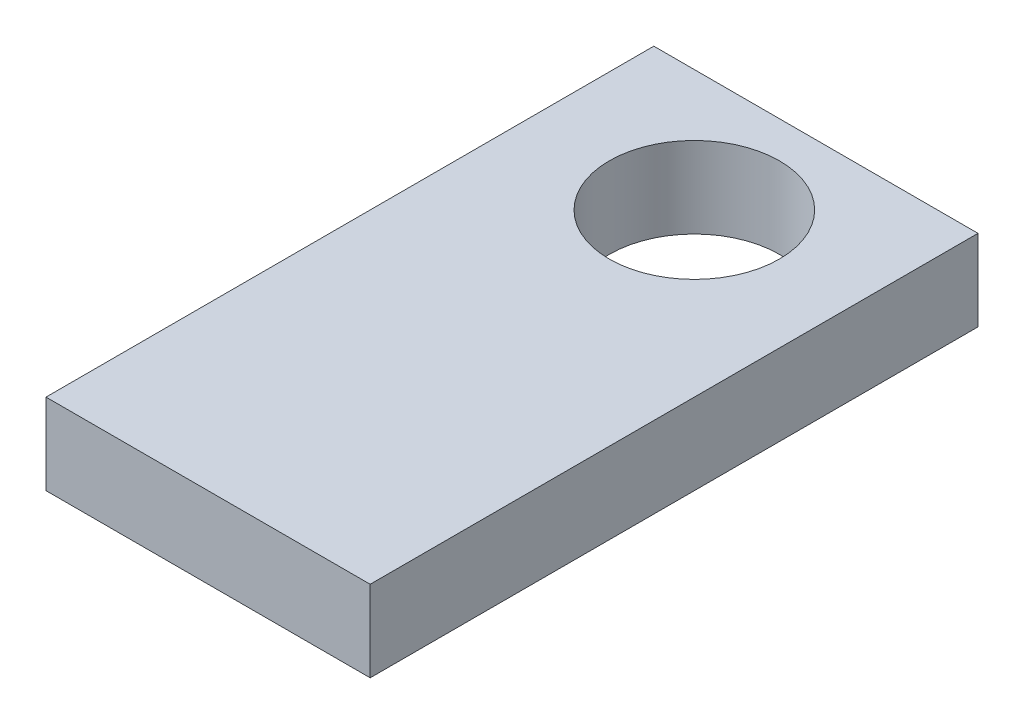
ISO-10303-21;
HEADER;
FILE_DESCRIPTION(('STEP AP214'),'2;1');
FILE_NAME('part.step','',(''),(''),'','','');
FILE_SCHEMA(('AUTOMOTIVE_DESIGN { 1 0 10303 214 1 1 1 1 }'));
ENDSEC;
DATA;
#1=APPLICATION_CONTEXT('core data for automotive mechanical design processes');
#2=APPLICATION_PROTOCOL_DEFINITION('international standard','automotive_design',2000,#1);
#3=PRODUCT_CONTEXT('',#1,'mechanical');
#4=PRODUCT('Part','Part','',(#3));
#5=PRODUCT_RELATED_PRODUCT_CATEGORY('part','',(#4));
#6=PRODUCT_DEFINITION_FORMATION('','',#4);
#7=PRODUCT_DEFINITION_CONTEXT('part definition',#1,'design');
#8=PRODUCT_DEFINITION('design','',#6,#7);
#9=PRODUCT_DEFINITION_SHAPE('','',#8);
#10=(LENGTH_UNIT() NAMED_UNIT(*) SI_UNIT(.MILLI.,.METRE.));
#11=(NAMED_UNIT(*) PLANE_ANGLE_UNIT() SI_UNIT($,.RADIAN.));
#12=(NAMED_UNIT(*) SI_UNIT($,.STERADIAN.) SOLID_ANGLE_UNIT());
#13=UNCERTAINTY_MEASURE_WITH_UNIT(LENGTH_MEASURE(1.E-05),#10,'distance_accuracy_value','');
#14=(GEOMETRIC_REPRESENTATION_CONTEXT(3) GLOBAL_UNCERTAINTY_ASSIGNED_CONTEXT((#13)) GLOBAL_UNIT_ASSIGNED_CONTEXT((#10,
#11,#12)) REPRESENTATION_CONTEXT('',''));
#15=CARTESIAN_POINT('',(0.,0.,0.));
#16=DIRECTION('',(0.,0.,1.));
#17=DIRECTION('',(1.,0.,0.));
#18=AXIS2_PLACEMENT_3D('',#15,#16,#17);
#19=CARTESIAN_POINT('',(0.,0.,150.));
#20=DIRECTION('',(1.,0.,0.));
#21=DIRECTION('',(0.,0.,-1.));
#22=AXIS2_PLACEMENT_3D('',#19,#20,#21);
#23=PLANE('',#22);
#24=DIRECTION('',(0.,-1.,0.));
#25=VECTOR('',#24,1.);
#26=CARTESIAN_POINT('',(0.,0.,0.));
#27=LINE('',#26,#25);
#28=CARTESIAN_POINT('',(0.,20.,0.));
#29=VERTEX_POINT('',#28);
#30=CARTESIAN_POINT('',(0.,0.,0.));
#31=VERTEX_POINT('',#30);
#32=EDGE_CURVE('E68',#29,#31,#27,.T.);
#33=ORIENTED_EDGE('',*,*,#32,.T.);
#34=DIRECTION('',(0.,0.,-1.));
#35=VECTOR('',#34,1.);
#36=CARTESIAN_POINT('',(0.,0.,150.));
#37=LINE('',#36,#35);
#38=CARTESIAN_POINT('',(0.,0.,150.));
#39=VERTEX_POINT('',#38);
#40=EDGE_CURVE('E11',#39,#31,#37,.T.);
#41=ORIENTED_EDGE('',*,*,#40,.F.);
#42=DIRECTION('',(0.,-1.,0.));
#43=VECTOR('',#42,1.);
#44=CARTESIAN_POINT('',(0.,0.,150.));
#45=LINE('',#44,#43);
#46=CARTESIAN_POINT('',(0.,20.,150.));
#47=VERTEX_POINT('',#46);
#48=EDGE_CURVE('E91',#47,#39,#45,.T.);
#49=ORIENTED_EDGE('',*,*,#48,.F.);
#50=DIRECTION('',(0.,0.,-1.));
#51=VECTOR('',#50,1.);
#52=CARTESIAN_POINT('',(0.,20.,150.));
#53=LINE('',#52,#51);
#54=EDGE_CURVE('E80',#47,#29,#53,.T.);
#55=ORIENTED_EDGE('',*,*,#54,.T.);
#56=EDGE_LOOP('',(#33,#41,#49,#55));
#57=FACE_BOUND('',#56,.T.);
#58=ADVANCED_FACE('F24',(#57),#23,.F.);
#59=CARTESIAN_POINT('',(0.,0.,150.));
#60=DIRECTION('',(0.,1.,0.));
#61=DIRECTION('',(0.,0.,1.));
#62=AXIS2_PLACEMENT_3D('',#59,#60,#61);
#63=PLANE('',#62);
#64=CARTESIAN_POINT('',(40.,0.,30.));
#65=DIRECTION('',(0.,1.,0.));
#66=DIRECTION('',(0.,0.,1.));
#67=AXIS2_PLACEMENT_3D('',#64,#65,#66);
#68=CIRCLE('',#67,21.);
#69=CARTESIAN_POINT('',(40.,0.,51.));
#70=VERTEX_POINT('',#69);
#71=EDGE_CURVE('E81',#70,#70,#68,.T.);
#72=ORIENTED_EDGE('',*,*,#71,.T.);
#73=EDGE_LOOP('',(#72));
#74=FACE_BOUND('',#73,.T.);
#75=DIRECTION('',(1.,0.,0.));
#76=VECTOR('',#75,1.);
#77=CARTESIAN_POINT('',(0.,0.,0.));
#78=LINE('',#77,#76);
#79=CARTESIAN_POINT('',(80.,0.,0.));
#80=VERTEX_POINT('',#79);
#81=EDGE_CURVE('E64',#31,#80,#78,.T.);
#82=ORIENTED_EDGE('',*,*,#81,.T.);
#83=DIRECTION('',(0.,0.,-1.));
#84=VECTOR('',#83,1.);
#85=CARTESIAN_POINT('',(80.,0.,150.));
#86=LINE('',#85,#84);
#87=CARTESIAN_POINT('',(80.,0.,150.));
#88=VERTEX_POINT('',#87);
#89=EDGE_CURVE('E31',#88,#80,#86,.T.);
#90=ORIENTED_EDGE('',*,*,#89,.F.);
#91=DIRECTION('',(1.,0.,0.));
#92=VECTOR('',#91,1.);
#93=CARTESIAN_POINT('',(0.,0.,150.));
#94=LINE('',#93,#92);
#95=EDGE_CURVE('E76',#39,#88,#94,.T.);
#96=ORIENTED_EDGE('',*,*,#95,.F.);
#97=ORIENTED_EDGE('',*,*,#40,.T.);
#98=EDGE_LOOP('',(#82,#90,#96,#97));
#99=FACE_BOUND('',#98,.T.);
#100=ADVANCED_FACE('F75',(#74,#99),#63,.F.);
#101=CARTESIAN_POINT('',(80.,0.,150.));
#102=DIRECTION('',(-1.,0.,0.));
#103=DIRECTION('',(0.,0.,1.));
#104=AXIS2_PLACEMENT_3D('',#101,#102,#103);
#105=PLANE('',#104);
#106=DIRECTION('',(0.,1.,0.));
#107=VECTOR('',#106,1.);
#108=CARTESIAN_POINT('',(80.,0.,0.));
#109=LINE('',#108,#107);
#110=CARTESIAN_POINT('',(80.,20.,0.));
#111=VERTEX_POINT('',#110);
#112=EDGE_CURVE('E69',#80,#111,#109,.T.);
#113=ORIENTED_EDGE('',*,*,#112,.T.);
#114=DIRECTION('',(0.,0.,-1.));
#115=VECTOR('',#114,1.);
#116=CARTESIAN_POINT('',(80.,20.,150.));
#117=LINE('',#116,#115);
#118=CARTESIAN_POINT('',(80.,20.,150.));
#119=VERTEX_POINT('',#118);
#120=EDGE_CURVE('E97',#119,#111,#117,.T.);
#121=ORIENTED_EDGE('',*,*,#120,.F.);
#122=DIRECTION('',(0.,1.,0.));
#123=VECTOR('',#122,1.);
#124=CARTESIAN_POINT('',(80.,0.,150.));
#125=LINE('',#124,#123);
#126=EDGE_CURVE('E43',#88,#119,#125,.T.);
#127=ORIENTED_EDGE('',*,*,#126,.F.);
#128=ORIENTED_EDGE('',*,*,#89,.T.);
#129=EDGE_LOOP('',(#113,#121,#127,#128));
#130=FACE_BOUND('',#129,.T.);
#131=ADVANCED_FACE('F100',(#130),#105,.F.);
#132=CARTESIAN_POINT('',(0.,20.,150.));
#133=DIRECTION('',(0.,-1.,0.));
#134=DIRECTION('',(0.,0.,-1.));
#135=AXIS2_PLACEMENT_3D('',#132,#133,#134);
#136=PLANE('',#135);
#137=CARTESIAN_POINT('',(40.,20.,30.));
#138=DIRECTION('',(0.,1.,0.));
#139=DIRECTION('',(0.,0.,1.));
#140=AXIS2_PLACEMENT_3D('',#137,#138,#139);
#141=CIRCLE('',#140,21.);
#142=CARTESIAN_POINT('',(40.,20.,51.));
#143=VERTEX_POINT('',#142);
#144=EDGE_CURVE('E84',#143,#143,#141,.T.);
#145=ORIENTED_EDGE('',*,*,#144,.F.);
#146=EDGE_LOOP('',(#145));
#147=FACE_BOUND('',#146,.T.);
#148=DIRECTION('',(-1.,0.,0.));
#149=VECTOR('',#148,1.);
#150=CARTESIAN_POINT('',(0.,20.,0.));
#151=LINE('',#150,#149);
#152=EDGE_CURVE('E89',#111,#29,#151,.T.);
#153=ORIENTED_EDGE('',*,*,#152,.T.);
#154=ORIENTED_EDGE('',*,*,#54,.F.);
#155=DIRECTION('',(-1.,0.,0.));
#156=VECTOR('',#155,1.);
#157=CARTESIAN_POINT('',(0.,20.,150.));
#158=LINE('',#157,#156);
#159=EDGE_CURVE('E38',#119,#47,#158,.T.);
#160=ORIENTED_EDGE('',*,*,#159,.F.);
#161=ORIENTED_EDGE('',*,*,#120,.T.);
#162=EDGE_LOOP('',(#153,#154,#160,#161));
#163=FACE_BOUND('',#162,.T.);
#164=ADVANCED_FACE('F102',(#147,#163),#136,.F.);
#165=CARTESIAN_POINT('',(0.,20.,150.));
#166=DIRECTION('',(0.,0.,-1.));
#167=DIRECTION('',(-1.,0.,0.));
#168=AXIS2_PLACEMENT_3D('',#165,#166,#167);
#169=PLANE('',#168);
#170=ORIENTED_EDGE('',*,*,#48,.T.);
#171=ORIENTED_EDGE('',*,*,#95,.T.);
#172=ORIENTED_EDGE('',*,*,#126,.T.);
#173=ORIENTED_EDGE('',*,*,#159,.T.);
#174=EDGE_LOOP('',(#170,#171,#172,#173));
#175=FACE_BOUND('',#174,.T.);
#176=ADVANCED_FACE('F103',(#175),#169,.F.);
#177=CARTESIAN_POINT('',(0.,20.,0.));
#178=DIRECTION('',(0.,0.,-1.));
#179=DIRECTION('',(-1.,0.,0.));
#180=AXIS2_PLACEMENT_3D('',#177,#178,#179);
#181=PLANE('',#180);
#182=ORIENTED_EDGE('',*,*,#32,.F.);
#183=ORIENTED_EDGE('',*,*,#152,.F.);
#184=ORIENTED_EDGE('',*,*,#112,.F.);
#185=ORIENTED_EDGE('',*,*,#81,.F.);
#186=EDGE_LOOP('',(#182,#183,#184,#185));
#187=FACE_BOUND('',#186,.T.);
#188=ADVANCED_FACE('F65',(#187),#181,.T.);
#189=CARTESIAN_POINT('',(40.,0.,30.));
#190=DIRECTION('',(0.,1.,0.));
#191=DIRECTION('',(0.,0.,1.));
#192=AXIS2_PLACEMENT_3D('',#189,#190,#191);
#193=CYLINDRICAL_SURFACE('',#192,21.);
#194=ORIENTED_EDGE('',*,*,#71,.F.);
#195=EDGE_LOOP('',(#194));
#196=FACE_BOUND('',#195,.T.);
#197=ORIENTED_EDGE('',*,*,#144,.T.);
#198=EDGE_LOOP('',(#197));
#199=FACE_BOUND('',#198,.T.);
#200=ADVANCED_FACE('F110',(#196,#199),#193,.F.);
#201=CLOSED_SHELL('',(#58,#100,#131,#164,#176,#188,#200));
#202=MANIFOLD_SOLID_BREP('B2',#201);
#203=ADVANCED_BREP_SHAPE_REPRESENTATION('',(#18,#202),#14);
#204=SHAPE_DEFINITION_REPRESENTATION(#9,#203);
ENDSEC;
END-ISO-10303-21;
